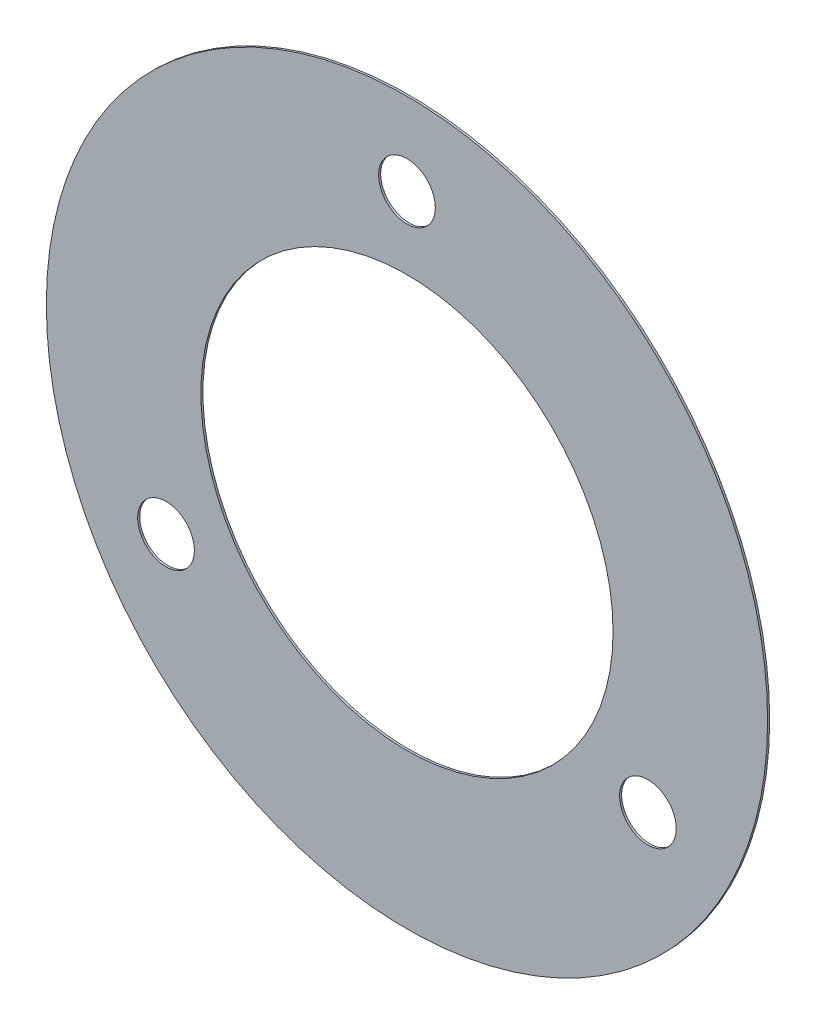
ISO-10303-21;
HEADER;
FILE_DESCRIPTION(('STEP AP214'),'2;1');
FILE_NAME('part.step','',(''),(''),'','','');
FILE_SCHEMA(('AUTOMOTIVE_DESIGN { 1 0 10303 214 1 1 1 1 }'));
ENDSEC;
DATA;
#1=APPLICATION_CONTEXT('core data for automotive mechanical design processes');
#2=APPLICATION_PROTOCOL_DEFINITION('international standard','automotive_design',2000,#1);
#3=PRODUCT_CONTEXT('',#1,'mechanical');
#4=PRODUCT('Part','Part','',(#3));
#5=PRODUCT_RELATED_PRODUCT_CATEGORY('part','',(#4));
#6=PRODUCT_DEFINITION_FORMATION('','',#4);
#7=PRODUCT_DEFINITION_CONTEXT('part definition',#1,'design');
#8=PRODUCT_DEFINITION('design','',#6,#7);
#9=PRODUCT_DEFINITION_SHAPE('','',#8);
#10=(LENGTH_UNIT() NAMED_UNIT(*) SI_UNIT(.MILLI.,.METRE.));
#11=(NAMED_UNIT(*) PLANE_ANGLE_UNIT() SI_UNIT($,.RADIAN.));
#12=(NAMED_UNIT(*) SI_UNIT($,.STERADIAN.) SOLID_ANGLE_UNIT());
#13=UNCERTAINTY_MEASURE_WITH_UNIT(LENGTH_MEASURE(1.E-05),#10,'distance_accuracy_value','');
#14=(GEOMETRIC_REPRESENTATION_CONTEXT(3) GLOBAL_UNCERTAINTY_ASSIGNED_CONTEXT((#13)) GLOBAL_UNIT_ASSIGNED_CONTEXT((#10,
#11,#12)) REPRESENTATION_CONTEXT('',''));
#15=CARTESIAN_POINT('',(0.,0.,0.));
#16=DIRECTION('',(0.,0.,1.));
#17=DIRECTION('',(1.,0.,0.));
#18=AXIS2_PLACEMENT_3D('',#15,#16,#17);
#19=CARTESIAN_POINT('',(0.,0.,0.400000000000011));
#20=DIRECTION('',(0.,0.,1.));
#21=DIRECTION('',(1.,0.,0.));
#22=AXIS2_PLACEMENT_3D('',#19,#20,#21);
#23=PLANE('',#22);
#24=CARTESIAN_POINT('',(-46.76537180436,-26.9999999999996,0.400000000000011));
#25=DIRECTION('',(0.,0.,1.));
#26=DIRECTION('',(-0.499999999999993,0.866025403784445,0.));
#27=AXIS2_PLACEMENT_3D('',#24,#25,#26);
#28=CIRCLE('',#27,5.5);
#29=CARTESIAN_POINT('',(-49.51537180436,-22.2368602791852,0.400000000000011));
#30=VERTEX_POINT('',#29);
#31=EDGE_CURVE('E67',#30,#30,#28,.T.);
#32=ORIENTED_EDGE('',*,*,#31,.F.);
#33=EDGE_LOOP('',(#32));
#34=FACE_BOUND('',#33,.T.);
#35=CARTESIAN_POINT('',(46.7653718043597,-27.0000000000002,0.399999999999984));
#36=DIRECTION('',(0.,0.,1.));
#37=DIRECTION('',(-0.500000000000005,-0.866025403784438,0.));
#38=AXIS2_PLACEMENT_3D('',#35,#36,#37);
#39=CIRCLE('',#38,5.5);
#40=CARTESIAN_POINT('',(44.0153718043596,-31.7631397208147,0.399999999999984));
#41=VERTEX_POINT('',#40);
#42=EDGE_CURVE('E61',#41,#41,#39,.T.);
#43=ORIENTED_EDGE('',*,*,#42,.F.);
#44=EDGE_LOOP('',(#43));
#45=FACE_BOUND('',#44,.T.);
#46=CARTESIAN_POINT('',(0.,54.0000000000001,0.400000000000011));
#47=DIRECTION('',(0.,0.,1.));
#48=DIRECTION('',(1.,0.,0.));
#49=AXIS2_PLACEMENT_3D('',#46,#47,#48);
#50=CIRCLE('',#49,5.5);
#51=CARTESIAN_POINT('',(5.50000000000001,54.0000000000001,0.400000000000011));
#52=VERTEX_POINT('',#51);
#53=EDGE_CURVE('E55',#52,#52,#50,.T.);
#54=ORIENTED_EDGE('',*,*,#53,.F.);
#55=EDGE_LOOP('',(#54));
#56=FACE_BOUND('',#55,.T.);
#57=CARTESIAN_POINT('',(0.,0.,0.400000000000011));
#58=DIRECTION('',(0.,0.,1.));
#59=DIRECTION('',(1.,0.,0.));
#60=AXIS2_PLACEMENT_3D('',#57,#58,#59);
#61=CIRCLE('',#60,70.);
#62=CARTESIAN_POINT('',(70.0000000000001,0.,0.400000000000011));
#63=VERTEX_POINT('',#62);
#64=EDGE_CURVE('E10',#63,#63,#61,.T.);
#65=ORIENTED_EDGE('',*,*,#64,.T.);
#66=EDGE_LOOP('',(#65));
#67=FACE_BOUND('',#66,.T.);
#68=CARTESIAN_POINT('',(0.,0.,0.400000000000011));
#69=DIRECTION('',(0.,0.,1.));
#70=DIRECTION('',(1.,0.,0.));
#71=AXIS2_PLACEMENT_3D('',#68,#69,#70);
#72=CIRCLE('',#71,40.);
#73=CARTESIAN_POINT('',(40.0000000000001,0.,0.400000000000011));
#74=VERTEX_POINT('',#73);
#75=EDGE_CURVE('E43',#74,#74,#72,.T.);
#76=ORIENTED_EDGE('',*,*,#75,.F.);
#77=EDGE_LOOP('',(#76));
#78=FACE_BOUND('',#77,.T.);
#79=ADVANCED_FACE('F32',(#34,#45,#56,#67,#78),#23,.T.);
#80=CARTESIAN_POINT('',(0.,0.,0.));
#81=DIRECTION('',(0.,0.,1.));
#82=DIRECTION('',(1.,0.,0.));
#83=AXIS2_PLACEMENT_3D('',#80,#81,#82);
#84=PLANE('',#83);
#85=CARTESIAN_POINT('',(-46.76537180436,-26.9999999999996,0.));
#86=DIRECTION('',(0.,0.,1.));
#87=DIRECTION('',(-0.499999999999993,0.866025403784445,0.));
#88=AXIS2_PLACEMENT_3D('',#85,#86,#87);
#89=CIRCLE('',#88,5.5);
#90=CARTESIAN_POINT('',(-49.51537180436,-22.2368602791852,0.));
#91=VERTEX_POINT('',#90);
#92=EDGE_CURVE('E64',#91,#91,#89,.T.);
#93=ORIENTED_EDGE('',*,*,#92,.T.);
#94=EDGE_LOOP('',(#93));
#95=FACE_BOUND('',#94,.T.);
#96=CARTESIAN_POINT('',(46.7653718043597,-27.0000000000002,0.));
#97=DIRECTION('',(0.,0.,1.));
#98=DIRECTION('',(-0.500000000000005,-0.866025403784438,0.));
#99=AXIS2_PLACEMENT_3D('',#96,#97,#98);
#100=CIRCLE('',#99,5.5);
#101=CARTESIAN_POINT('',(44.0153718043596,-31.7631397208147,0.));
#102=VERTEX_POINT('',#101);
#103=EDGE_CURVE('E58',#102,#102,#100,.T.);
#104=ORIENTED_EDGE('',*,*,#103,.T.);
#105=EDGE_LOOP('',(#104));
#106=FACE_BOUND('',#105,.T.);
#107=CARTESIAN_POINT('',(0.,54.0000000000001,0.));
#108=DIRECTION('',(0.,0.,1.));
#109=DIRECTION('',(1.,0.,0.));
#110=AXIS2_PLACEMENT_3D('',#107,#108,#109);
#111=CIRCLE('',#110,5.5);
#112=CARTESIAN_POINT('',(5.50000000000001,54.0000000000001,0.));
#113=VERTEX_POINT('',#112);
#114=EDGE_CURVE('E52',#113,#113,#111,.T.);
#115=ORIENTED_EDGE('',*,*,#114,.T.);
#116=EDGE_LOOP('',(#115));
#117=FACE_BOUND('',#116,.T.);
#118=CARTESIAN_POINT('',(0.,0.,0.));
#119=DIRECTION('',(0.,0.,1.));
#120=DIRECTION('',(1.,0.,0.));
#121=AXIS2_PLACEMENT_3D('',#118,#119,#120);
#122=CIRCLE('',#121,70.);
#123=CARTESIAN_POINT('',(70.0000000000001,0.,0.));
#124=VERTEX_POINT('',#123);
#125=EDGE_CURVE('E39',#124,#124,#122,.T.);
#126=ORIENTED_EDGE('',*,*,#125,.F.);
#127=EDGE_LOOP('',(#126));
#128=FACE_BOUND('',#127,.T.);
#129=CARTESIAN_POINT('',(0.,0.,0.));
#130=DIRECTION('',(0.,0.,1.));
#131=DIRECTION('',(1.,0.,0.));
#132=AXIS2_PLACEMENT_3D('',#129,#130,#131);
#133=CIRCLE('',#132,40.);
#134=CARTESIAN_POINT('',(40.0000000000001,0.,0.));
#135=VERTEX_POINT('',#134);
#136=EDGE_CURVE('E47',#135,#135,#133,.T.);
#137=ORIENTED_EDGE('',*,*,#136,.T.);
#138=EDGE_LOOP('',(#137));
#139=FACE_BOUND('',#138,.T.);
#140=ADVANCED_FACE('F75',(#95,#106,#117,#128,#139),#84,.F.);
#141=CARTESIAN_POINT('',(0.,0.,0.400000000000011));
#142=DIRECTION('',(0.,0.,-1.));
#143=DIRECTION('',(-1.,0.,0.));
#144=AXIS2_PLACEMENT_3D('',#141,#142,#143);
#145=CYLINDRICAL_SURFACE('',#144,70.);
#146=ORIENTED_EDGE('',*,*,#64,.F.);
#147=EDGE_LOOP('',(#146));
#148=FACE_BOUND('',#147,.T.);
#149=ORIENTED_EDGE('',*,*,#125,.T.);
#150=EDGE_LOOP('',(#149));
#151=FACE_BOUND('',#150,.T.);
#152=ADVANCED_FACE('F34',(#148,#151),#145,.T.);
#153=CARTESIAN_POINT('',(0.,0.,0.400000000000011));
#154=DIRECTION('',(0.,0.,-1.));
#155=DIRECTION('',(-1.,0.,0.));
#156=AXIS2_PLACEMENT_3D('',#153,#154,#155);
#157=CYLINDRICAL_SURFACE('',#156,40.);
#158=ORIENTED_EDGE('',*,*,#75,.T.);
#159=EDGE_LOOP('',(#158));
#160=FACE_BOUND('',#159,.T.);
#161=ORIENTED_EDGE('',*,*,#136,.F.);
#162=EDGE_LOOP('',(#161));
#163=FACE_BOUND('',#162,.T.);
#164=ADVANCED_FACE('F82',(#160,#163),#157,.F.);
#165=CARTESIAN_POINT('',(0.,54.0000000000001,0.));
#166=DIRECTION('',(0.,0.,1.));
#167=DIRECTION('',(1.,0.,0.));
#168=AXIS2_PLACEMENT_3D('',#165,#166,#167);
#169=CYLINDRICAL_SURFACE('',#168,5.5);
#170=ORIENTED_EDGE('',*,*,#114,.F.);
#171=EDGE_LOOP('',(#170));
#172=FACE_BOUND('',#171,.T.);
#173=ORIENTED_EDGE('',*,*,#53,.T.);
#174=EDGE_LOOP('',(#173));
#175=FACE_BOUND('',#174,.T.);
#176=ADVANCED_FACE('F85',(#172,#175),#169,.F.);
#177=CARTESIAN_POINT('',(46.7653718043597,-27.0000000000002,0.));
#178=DIRECTION('',(0.,0.,1.));
#179=DIRECTION('',(1.,0.,0.));
#180=AXIS2_PLACEMENT_3D('',#177,#178,#179);
#181=CYLINDRICAL_SURFACE('',#180,5.5);
#182=ORIENTED_EDGE('',*,*,#103,.F.);
#183=EDGE_LOOP('',(#182));
#184=FACE_BOUND('',#183,.T.);
#185=ORIENTED_EDGE('',*,*,#42,.T.);
#186=EDGE_LOOP('',(#185));
#187=FACE_BOUND('',#186,.T.);
#188=ADVANCED_FACE('F100',(#184,#187),#181,.F.);
#189=CARTESIAN_POINT('',(-46.76537180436,-26.9999999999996,0.));
#190=DIRECTION('',(0.,0.,1.));
#191=DIRECTION('',(1.,0.,0.));
#192=AXIS2_PLACEMENT_3D('',#189,#190,#191);
#193=CYLINDRICAL_SURFACE('',#192,5.5);
#194=ORIENTED_EDGE('',*,*,#92,.F.);
#195=EDGE_LOOP('',(#194));
#196=FACE_BOUND('',#195,.T.);
#197=ORIENTED_EDGE('',*,*,#31,.T.);
#198=EDGE_LOOP('',(#197));
#199=FACE_BOUND('',#198,.T.);
#200=ADVANCED_FACE('F71',(#196,#199),#193,.F.);
#201=CLOSED_SHELL('',(#79,#140,#152,#164,#176,#188,#200));
#202=MANIFOLD_SOLID_BREP('B2',#201);
#203=ADVANCED_BREP_SHAPE_REPRESENTATION('',(#18,#202),#14);
#204=SHAPE_DEFINITION_REPRESENTATION(#9,#203);
ENDSEC;
END-ISO-10303-21;
